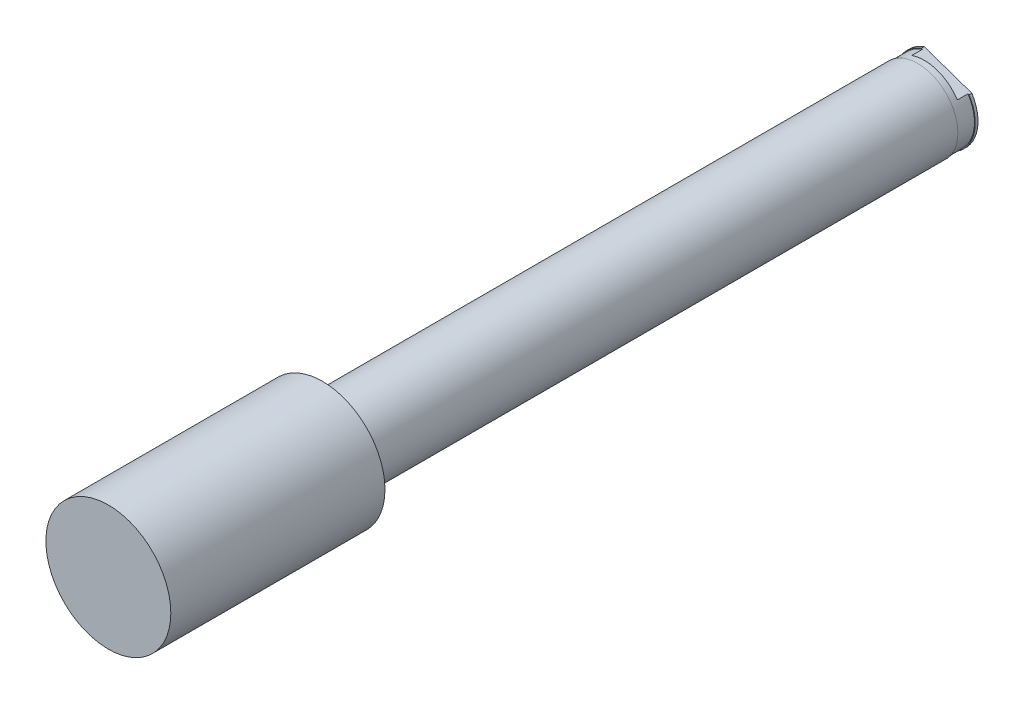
ISO-10303-21;
HEADER;
FILE_DESCRIPTION(('STEP AP214'),'2;1');
FILE_NAME('part.step','',(''),(''),'','','');
FILE_SCHEMA(('AUTOMOTIVE_DESIGN { 1 0 10303 214 1 1 1 1 }'));
ENDSEC;
DATA;
#1=APPLICATION_CONTEXT('core data for automotive mechanical design processes');
#2=APPLICATION_PROTOCOL_DEFINITION('international standard','automotive_design',2000,#1);
#3=PRODUCT_CONTEXT('',#1,'mechanical');
#4=PRODUCT('Part','Part','',(#3));
#5=PRODUCT_RELATED_PRODUCT_CATEGORY('part','',(#4));
#6=PRODUCT_DEFINITION_FORMATION('','',#4);
#7=PRODUCT_DEFINITION_CONTEXT('part definition',#1,'design');
#8=PRODUCT_DEFINITION('design','',#6,#7);
#9=PRODUCT_DEFINITION_SHAPE('','',#8);
#10=(LENGTH_UNIT() NAMED_UNIT(*) SI_UNIT(.MILLI.,.METRE.));
#11=(NAMED_UNIT(*) PLANE_ANGLE_UNIT() SI_UNIT($,.RADIAN.));
#12=(NAMED_UNIT(*) SI_UNIT($,.STERADIAN.) SOLID_ANGLE_UNIT());
#13=UNCERTAINTY_MEASURE_WITH_UNIT(LENGTH_MEASURE(1.E-05),#10,'distance_accuracy_value','');
#14=(GEOMETRIC_REPRESENTATION_CONTEXT(3) GLOBAL_UNCERTAINTY_ASSIGNED_CONTEXT((#13)) GLOBAL_UNIT_ASSIGNED_CONTEXT((#10,
#11,#12)) REPRESENTATION_CONTEXT('',''));
#15=CARTESIAN_POINT('',(0.,0.,0.));
#16=DIRECTION('',(0.,0.,1.));
#17=DIRECTION('',(1.,0.,0.));
#18=AXIS2_PLACEMENT_3D('',#15,#16,#17);
#19=CARTESIAN_POINT('',(0.,0.,38.1));
#20=DIRECTION('',(0.,0.,-1.));
#21=DIRECTION('',(-1.,0.,0.));
#22=AXIS2_PLACEMENT_3D('',#19,#20,#21);
#23=CYLINDRICAL_SURFACE('',#22,11.1125);
#24=CARTESIAN_POINT('',(0.,0.,38.1));
#25=DIRECTION('',(0.,0.,1.));
#26=DIRECTION('',(1.,0.,0.));
#27=AXIS2_PLACEMENT_3D('',#24,#25,#26);
#28=CIRCLE('',#27,11.1125);
#29=CARTESIAN_POINT('',(11.1125,0.,38.1));
#30=VERTEX_POINT('',#29);
#31=EDGE_CURVE('E167',#30,#30,#28,.T.);
#32=ORIENTED_EDGE('',*,*,#31,.F.);
#33=EDGE_LOOP('',(#32));
#34=FACE_BOUND('',#33,.T.);
#35=CARTESIAN_POINT('',(0.,0.,0.));
#36=DIRECTION('',(0.,0.,1.));
#37=DIRECTION('',(1.,0.,0.));
#38=AXIS2_PLACEMENT_3D('',#35,#36,#37);
#39=CIRCLE('',#38,11.1125);
#40=CARTESIAN_POINT('',(11.1125,0.,0.));
#41=VERTEX_POINT('',#40);
#42=EDGE_CURVE('E168',#41,#41,#39,.T.);
#43=ORIENTED_EDGE('',*,*,#42,.T.);
#44=EDGE_LOOP('',(#43));
#45=FACE_BOUND('',#44,.T.);
#46=ADVANCED_FACE('F16',(#34,#45),#23,.T.);
#47=CARTESIAN_POINT('',(0.,0.,38.1));
#48=DIRECTION('',(0.,0.,1.));
#49=DIRECTION('',(1.,0.,0.));
#50=AXIS2_PLACEMENT_3D('',#47,#48,#49);
#51=PLANE('',#50);
#52=ORIENTED_EDGE('',*,*,#31,.T.);
#53=EDGE_LOOP('',(#52));
#54=FACE_BOUND('',#53,.T.);
#55=ADVANCED_FACE('F359',(#54),#51,.T.);
#56=CARTESIAN_POINT('',(0.,0.,0.));
#57=DIRECTION('',(0.,0.,1.));
#58=DIRECTION('',(1.,0.,0.));
#59=AXIS2_PLACEMENT_3D('',#56,#57,#58);
#60=PLANE('',#59);
#61=CARTESIAN_POINT('',(0.,0.,0.));
#62=DIRECTION('',(0.,0.,1.));
#63=DIRECTION('',(1.,0.,0.));
#64=AXIS2_PLACEMENT_3D('',#61,#62,#63);
#65=CIRCLE('',#64,7.1501);
#66=CARTESIAN_POINT('',(7.1501,0.,0.));
#67=VERTEX_POINT('',#66);
#68=EDGE_CURVE('E161',#67,#67,#65,.T.);
#69=ORIENTED_EDGE('',*,*,#68,.T.);
#70=EDGE_LOOP('',(#69));
#71=FACE_BOUND('',#70,.T.);
#72=ORIENTED_EDGE('',*,*,#42,.F.);
#73=EDGE_LOOP('',(#72));
#74=FACE_BOUND('',#73,.T.);
#75=ADVANCED_FACE('F348',(#71,#74),#60,.F.);
#76=CARTESIAN_POINT('',(0.,7.1501,-105.88259999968));
#77=DIRECTION('',(0.,0.,-1.));
#78=DIRECTION('',(-1.,0.,0.));
#79=AXIS2_PLACEMENT_3D('',#76,#77,#78);
#80=PLANE('',#79);
#81=CARTESIAN_POINT('',(0.,0.,-105.88259999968));
#82=DIRECTION('',(0.,0.,-1.));
#83=DIRECTION('',(-1.,0.,0.));
#84=AXIS2_PLACEMENT_3D('',#81,#82,#83);
#85=CIRCLE('',#84,7.0231);
#86=CARTESIAN_POINT('',(-7.0231,0.,-105.88259999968));
#87=VERTEX_POINT('',#86);
#88=EDGE_CURVE('E10',#87,#87,#85,.T.);
#89=ORIENTED_EDGE('',*,*,#88,.F.);
#90=EDGE_LOOP('',(#89));
#91=FACE_BOUND('',#90,.T.);
#92=CARTESIAN_POINT('',(0.,0.,-105.88259999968));
#93=DIRECTION('',(0.,0.,1.));
#94=DIRECTION('',(1.,0.,0.));
#95=AXIS2_PLACEMENT_3D('',#92,#93,#94);
#96=CIRCLE('',#95,7.1501);
#97=CARTESIAN_POINT('',(7.1501,0.,-105.88259999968));
#98=VERTEX_POINT('',#97);
#99=EDGE_CURVE('E164',#98,#98,#96,.T.);
#100=ORIENTED_EDGE('',*,*,#99,.F.);
#101=EDGE_LOOP('',(#100));
#102=FACE_BOUND('',#101,.T.);
#103=ADVANCED_FACE('F337',(#91,#102),#80,.T.);
#104=CARTESIAN_POINT('',(0.,0.,-71.8992983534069));
#105=DIRECTION('',(0.,0.,1.));
#106=DIRECTION('',(1.,0.,0.));
#107=AXIS2_PLACEMENT_3D('',#104,#105,#106);
#108=CYLINDRICAL_SURFACE('',#107,7.1501);
#109=ORIENTED_EDGE('',*,*,#99,.T.);
#110=EDGE_LOOP('',(#109));
#111=FACE_BOUND('',#110,.T.);
#112=ORIENTED_EDGE('',*,*,#68,.F.);
#113=EDGE_LOOP('',(#112));
#114=FACE_BOUND('',#113,.T.);
#115=ADVANCED_FACE('F326',(#111,#114),#108,.T.);
#116=CARTESIAN_POINT('',(0.,0.,-90.41399999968));
#117=DIRECTION('',(0.,0.,-1.));
#118=DIRECTION('',(-1.,0.,0.));
#119=AXIS2_PLACEMENT_3D('',#116,#117,#118);
#120=PLANE('',#119);
#121=CARTESIAN_POINT('',(0.,0.,-90.41399999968));
#122=DIRECTION('',(0.,0.,-1.));
#123=DIRECTION('',(-1.,0.,0.));
#124=AXIS2_PLACEMENT_3D('',#121,#122,#123);
#125=CIRCLE('',#124,2.7051);
#126=CARTESIAN_POINT('',(-2.7051,0.,-90.41399999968));
#127=VERTEX_POINT('',#126);
#128=EDGE_CURVE('E155',#127,#127,#125,.T.);
#129=ORIENTED_EDGE('',*,*,#128,.T.);
#130=EDGE_LOOP('',(#129));
#131=FACE_BOUND('',#130,.T.);
#132=ADVANCED_FACE('F176',(#131),#120,.T.);
#133=CARTESIAN_POINT('',(0.,0.,-90.41399999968));
#134=DIRECTION('',(0.,0.,-1.));
#135=DIRECTION('',(-1.,0.,0.));
#136=AXIS2_PLACEMENT_3D('',#133,#134,#135);
#137=CYLINDRICAL_SURFACE('',#136,2.7051);
#138=ORIENTED_EDGE('',*,*,#128,.F.);
#139=EDGE_LOOP('',(#138));
#140=FACE_BOUND('',#139,.T.);
#141=CARTESIAN_POINT('',(0.,0.,-93.96399999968));
#142=DIRECTION('',(0.,0.,-1.));
#143=DIRECTION('',(-1.,0.,0.));
#144=AXIS2_PLACEMENT_3D('',#141,#142,#143);
#145=CIRCLE('',#144,2.7051);
#146=CARTESIAN_POINT('',(-2.7051,0.,-93.96399999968));
#147=VERTEX_POINT('',#146);
#148=EDGE_CURVE('E25',#147,#147,#145,.F.);
#149=ORIENTED_EDGE('',*,*,#148,.F.);
#150=EDGE_LOOP('',(#149));
#151=FACE_BOUND('',#150,.T.);
#152=ADVANCED_FACE('F178',(#140,#151),#137,.F.);
#153=CARTESIAN_POINT('',(0.,0.,-109.46399999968));
#154=DIRECTION('',(0.,0.,-1.));
#155=DIRECTION('',(-0.945518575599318,0.325568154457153,0.));
#156=AXIS2_PLACEMENT_3D('',#153,#154,#155);
#157=CYLINDRICAL_SURFACE('',#156,3.125);
#158=CARTESIAN_POINT('',(0.,0.,-108.96399999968));
#159=DIRECTION('',(0.,0.,-1.));
#160=DIRECTION('',(-1.,0.,0.));
#161=AXIS2_PLACEMENT_3D('',#158,#159,#160);
#162=CIRCLE('',#161,3.125);
#163=CARTESIAN_POINT('',(-3.125,0.,-108.96399999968));
#164=VERTEX_POINT('',#163);
#165=EDGE_CURVE('E153',#164,#164,#162,.T.);
#166=ORIENTED_EDGE('',*,*,#165,.F.);
#167=EDGE_LOOP('',(#166));
#168=FACE_BOUND('',#167,.T.);
#169=CARTESIAN_POINT('',(0.,0.,-109.46399999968));
#170=DIRECTION('',(0.,0.,-1.));
#171=DIRECTION('',(-0.945518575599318,0.325568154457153,0.));
#172=AXIS2_PLACEMENT_3D('',#169,#170,#171);
#173=CIRCLE('',#172,3.125);
#174=CARTESIAN_POINT('',(-2.95474554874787,1.0174004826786,-109.46399999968));
#175=VERTEX_POINT('',#174);
#176=EDGE_CURVE('E137',#175,#175,#173,.T.);
#177=ORIENTED_EDGE('',*,*,#176,.T.);
#178=EDGE_LOOP('',(#177));
#179=FACE_BOUND('',#178,.T.);
#180=ADVANCED_FACE('F181',(#168,#179),#157,.F.);
#181=CARTESIAN_POINT('',(0.,0.,-108.96399999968));
#182=DIRECTION('',(0.,0.,-1.));
#183=DIRECTION('',(-0.945518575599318,0.325568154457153,0.));
#184=AXIS2_PLACEMENT_3D('',#181,#182,#183);
#185=PLANE('',#184);
#186=CARTESIAN_POINT('',(0.,0.,-108.96399999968));
#187=DIRECTION('',(0.,0.,-1.));
#188=DIRECTION('',(-0.945518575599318,0.325568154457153,0.));
#189=AXIS2_PLACEMENT_3D('',#186,#187,#188);
#190=CIRCLE('',#189,2.50063);
#191=CARTESIAN_POINT('',(-2.36439211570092,0.81412549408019,-108.96399999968));
#192=VERTEX_POINT('',#191);
#193=EDGE_CURVE('E110',#192,#192,#190,.T.);
#194=ORIENTED_EDGE('',*,*,#193,.F.);
#195=EDGE_LOOP('',(#194));
#196=FACE_BOUND('',#195,.T.);
#197=ORIENTED_EDGE('',*,*,#165,.T.);
#198=EDGE_LOOP('',(#197));
#199=FACE_BOUND('',#198,.T.);
#200=ADVANCED_FACE('F198',(#196,#199),#185,.T.);
#201=CARTESIAN_POINT('',(0.,0.,-93.96399999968));
#202=DIRECTION('',(0.,0.,-1.));
#203=DIRECTION('',(-0.945518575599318,0.325568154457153,0.));
#204=AXIS2_PLACEMENT_3D('',#201,#202,#203);
#205=CYLINDRICAL_SURFACE('',#204,2.50063);
#206=CARTESIAN_POINT('',(0.,0.,-93.96399999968));
#207=DIRECTION('',(0.,0.,-1.));
#208=DIRECTION('',(-0.945518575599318,0.325568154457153,0.));
#209=AXIS2_PLACEMENT_3D('',#206,#207,#208);
#210=CIRCLE('',#209,2.50063);
#211=CARTESIAN_POINT('',(-2.36439211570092,0.81412549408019,-93.96399999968));
#212=VERTEX_POINT('',#211);
#213=EDGE_CURVE('E112',#212,#212,#210,.T.);
#214=ORIENTED_EDGE('',*,*,#213,.F.);
#215=EDGE_LOOP('',(#214));
#216=FACE_BOUND('',#215,.T.);
#217=ORIENTED_EDGE('',*,*,#193,.T.);
#218=EDGE_LOOP('',(#217));
#219=FACE_BOUND('',#218,.T.);
#220=ADVANCED_FACE('F187',(#216,#219),#205,.F.);
#221=CARTESIAN_POINT('',(0.,0.,-93.96399999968));
#222=DIRECTION('',(0.,0.,-1.));
#223=DIRECTION('',(-0.945518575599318,0.325568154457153,0.));
#224=AXIS2_PLACEMENT_3D('',#221,#222,#223);
#225=PLANE('',#224);
#226=ORIENTED_EDGE('',*,*,#213,.T.);
#227=EDGE_LOOP('',(#226));
#228=FACE_BOUND('',#227,.T.);
#229=ORIENTED_EDGE('',*,*,#148,.T.);
#230=EDGE_LOOP('',(#229));
#231=FACE_BOUND('',#230,.T.);
#232=ADVANCED_FACE('F185',(#228,#231),#225,.F.);
#233=CARTESIAN_POINT('',(0.,0.,-109.46399999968));
#234=DIRECTION('',(0.,0.,1.));
#235=DIRECTION('',(0.945518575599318,-0.325568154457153,0.));
#236=AXIS2_PLACEMENT_3D('',#233,#234,#235);
#237=PLANE('',#236);
#238=CARTESIAN_POINT('',(0.,0.,-109.46399999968));
#239=DIRECTION('',(0.,0.,-1.));
#240=DIRECTION('',(-0.945518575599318,0.325568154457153,0.));
#241=AXIS2_PLACEMENT_3D('',#238,#239,#240);
#242=CIRCLE('',#241,7.1501);
#243=CARTESIAN_POINT('',(-6.0586271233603,-3.79696818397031,-109.46399999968));
#244=VERTEX_POINT('',#243);
#245=CARTESIAN_POINT('',(-2.43661629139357,6.72211507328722,-109.46399999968));
#246=VERTEX_POINT('',#245);
#247=EDGE_CURVE('E116',#244,#246,#242,.T.);
#248=ORIENTED_EDGE('',*,*,#247,.T.);
#249=DIRECTION('',(-0.945518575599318,0.325568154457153,0.));
#250=VECTOR('',#249,1.);
#251=CARTESIAN_POINT('',(6.05862712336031,3.7969681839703,-109.46399999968));
#252=LINE('',#251,#250);
#253=CARTESIAN_POINT('',(6.05862712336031,3.7969681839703,-109.46399999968));
#254=VERTEX_POINT('',#253);
#255=EDGE_CURVE('E135',#254,#246,#252,.T.);
#256=ORIENTED_EDGE('',*,*,#255,.F.);
#257=CARTESIAN_POINT('',(2.43661629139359,-6.72211507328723,-109.46399999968));
#258=VERTEX_POINT('',#257);
#259=EDGE_CURVE('E119',#254,#258,#242,.T.);
#260=ORIENTED_EDGE('',*,*,#259,.T.);
#261=DIRECTION('',(0.945518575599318,-0.325568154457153,0.));
#262=VECTOR('',#261,1.);
#263=CARTESIAN_POINT('',(2.43661629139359,-6.72211507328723,-109.46399999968));
#264=LINE('',#263,#262);
#265=EDGE_CURVE('E126',#244,#258,#264,.T.);
#266=ORIENTED_EDGE('',*,*,#265,.F.);
#267=EDGE_LOOP('',(#248,#256,#260,#266));
#268=FACE_BOUND('',#267,.T.);
#269=ORIENTED_EDGE('',*,*,#176,.F.);
#270=EDGE_LOOP('',(#269));
#271=FACE_BOUND('',#270,.T.);
#272=ADVANCED_FACE('F18',(#268,#271),#237,.F.);
#273=CARTESIAN_POINT('',(0.,0.,-110.458542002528));
#274=DIRECTION('',(0.,0.,-1.));
#275=DIRECTION('',(-0.945518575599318,0.325568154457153,0.));
#276=AXIS2_PLACEMENT_3D('',#273,#274,#275);
#277=CYLINDRICAL_SURFACE('',#276,7.1501);
#278=DIRECTION('',(0.,0.,-1.));
#279=VECTOR('',#278,1.);
#280=CARTESIAN_POINT('',(-6.0586271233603,-3.79696818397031,-107.07639999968));
#281=LINE('',#280,#279);
#282=CARTESIAN_POINT('',(-6.0586271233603,-3.79696818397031,-108.96399999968));
#283=VERTEX_POINT('',#282);
#284=EDGE_CURVE('E122',#283,#244,#281,.T.);
#285=ORIENTED_EDGE('',*,*,#284,.F.);
#286=CARTESIAN_POINT('',(0.,0.,-108.96399999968));
#287=DIRECTION('',(0.,0.,-1.));
#288=DIRECTION('',(-0.945518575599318,0.325568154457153,0.));
#289=AXIS2_PLACEMENT_3D('',#286,#287,#288);
#290=CIRCLE('',#289,7.1501);
#291=CARTESIAN_POINT('',(-2.43661629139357,6.72211507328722,-108.96399999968));
#292=VERTEX_POINT('',#291);
#293=EDGE_CURVE('E151',#283,#292,#290,.T.);
#294=ORIENTED_EDGE('',*,*,#293,.T.);
#295=DIRECTION('',(0.,0.,-1.));
#296=VECTOR('',#295,1.);
#297=CARTESIAN_POINT('',(-2.43661629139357,6.72211507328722,-107.07639999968));
#298=LINE('',#297,#296);
#299=EDGE_CURVE('E109',#292,#246,#298,.T.);
#300=ORIENTED_EDGE('',*,*,#299,.T.);
#301=ORIENTED_EDGE('',*,*,#247,.F.);
#302=EDGE_LOOP('',(#285,#294,#300,#301));
#303=FACE_BOUND('',#302,.T.);
#304=ADVANCED_FACE('F196',(#303),#277,.T.);
#305=DIRECTION('',(0.,0.,-1.));
#306=VECTOR('',#305,1.);
#307=CARTESIAN_POINT('',(6.05862712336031,3.7969681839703,-107.07639999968));
#308=LINE('',#307,#306);
#309=CARTESIAN_POINT('',(6.05862712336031,3.7969681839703,-108.96399999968));
#310=VERTEX_POINT('',#309);
#311=EDGE_CURVE('E131',#310,#254,#308,.T.);
#312=ORIENTED_EDGE('',*,*,#311,.F.);
#313=CARTESIAN_POINT('',(2.43661629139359,-6.72211507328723,-108.96399999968));
#314=VERTEX_POINT('',#313);
#315=EDGE_CURVE('E150',#310,#314,#290,.T.);
#316=ORIENTED_EDGE('',*,*,#315,.T.);
#317=DIRECTION('',(0.,0.,-1.));
#318=VECTOR('',#317,1.);
#319=CARTESIAN_POINT('',(2.43661629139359,-6.72211507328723,-107.07639999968));
#320=LINE('',#319,#318);
#321=EDGE_CURVE('E41',#314,#258,#320,.T.);
#322=ORIENTED_EDGE('',*,*,#321,.T.);
#323=ORIENTED_EDGE('',*,*,#259,.F.);
#324=EDGE_LOOP('',(#312,#316,#322,#323));
#325=FACE_BOUND('',#324,.T.);
#326=ADVANCED_FACE('F224',(#325),#277,.T.);
#327=CARTESIAN_POINT('',(0.,0.,-107.07639999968));
#328=DIRECTION('',(0.,0.,-1.));
#329=DIRECTION('',(-0.945518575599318,0.325568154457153,0.));
#330=AXIS2_PLACEMENT_3D('',#327,#328,#329);
#331=PLANE('',#330);
#332=DIRECTION('',(0.945518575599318,-0.325568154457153,0.));
#333=VECTOR('',#332,1.);
#334=CARTESIAN_POINT('',(2.43661629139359,-6.72211507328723,-107.07639999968));
#335=LINE('',#334,#333);
#336=CARTESIAN_POINT('',(-5.86477942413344,-3.86371529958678,-107.07639999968));
#337=VERTEX_POINT('',#336);
#338=CARTESIAN_POINT('',(2.24276859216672,-6.65536795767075,-107.07639999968));
#339=VERTEX_POINT('',#338);
#340=EDGE_CURVE('E124',#337,#339,#335,.T.);
#341=ORIENTED_EDGE('',*,*,#340,.T.);
#342=CARTESIAN_POINT('',(0.,0.,-107.07639999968));
#343=DIRECTION('',(0.,0.,-1.));
#344=DIRECTION('',(-0.945518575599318,0.325568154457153,0.));
#345=AXIS2_PLACEMENT_3D('',#342,#343,#344);
#346=CIRCLE('',#345,7.0231);
#347=EDGE_CURVE('E96',#339,#337,#346,.T.);
#348=ORIENTED_EDGE('',*,*,#347,.T.);
#349=EDGE_LOOP('',(#341,#348));
#350=FACE_BOUND('',#349,.T.);
#351=ADVANCED_FACE('F221',(#350),#331,.T.);
#352=CARTESIAN_POINT('',(0.,0.,-108.96399999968));
#353=DIRECTION('',(0.,0.,-1.));
#354=DIRECTION('',(-0.945518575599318,0.325568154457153,0.));
#355=AXIS2_PLACEMENT_3D('',#352,#353,#354);
#356=PLANE('',#355);
#357=CARTESIAN_POINT('',(0.,0.,-108.96399999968));
#358=DIRECTION('',(0.,0.,-1.));
#359=DIRECTION('',(-0.945518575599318,0.325568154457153,0.));
#360=AXIS2_PLACEMENT_3D('',#357,#358,#359);
#361=CIRCLE('',#360,7.0231);
#362=CARTESIAN_POINT('',(-5.86477942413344,-3.86371529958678,-108.96399999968));
#363=VERTEX_POINT('',#362);
#364=CARTESIAN_POINT('',(-2.24276859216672,6.65536795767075,-108.96399999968));
#365=VERTEX_POINT('',#364);
#366=EDGE_CURVE('E89',#363,#365,#361,.T.);
#367=ORIENTED_EDGE('',*,*,#366,.T.);
#368=DIRECTION('',(0.945518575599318,-0.325568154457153,0.));
#369=VECTOR('',#368,1.);
#370=CARTESIAN_POINT('',(6.05862712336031,3.7969681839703,-108.96399999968));
#371=LINE('',#370,#369);
#372=EDGE_CURVE('E100',#292,#365,#371,.T.);
#373=ORIENTED_EDGE('',*,*,#372,.F.);
#374=ORIENTED_EDGE('',*,*,#293,.F.);
#375=DIRECTION('',(-0.945518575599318,0.325568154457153,0.));
#376=VECTOR('',#375,1.);
#377=CARTESIAN_POINT('',(2.43661629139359,-6.72211507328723,-108.96399999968));
#378=LINE('',#377,#376);
#379=EDGE_CURVE('E103',#363,#283,#378,.T.);
#380=ORIENTED_EDGE('',*,*,#379,.F.);
#381=EDGE_LOOP('',(#367,#373,#374,#380));
#382=FACE_BOUND('',#381,.T.);
#383=ADVANCED_FACE('F99',(#382),#356,.F.);
#384=CARTESIAN_POINT('',(0.,0.,-107.07639999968));
#385=DIRECTION('',(0.,0.,-1.));
#386=DIRECTION('',(-0.945518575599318,0.325568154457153,0.));
#387=AXIS2_PLACEMENT_3D('',#384,#385,#386);
#388=PLANE('',#387);
#389=DIRECTION('',(-0.945518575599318,0.325568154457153,0.));
#390=VECTOR('',#389,1.);
#391=CARTESIAN_POINT('',(6.05862712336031,3.7969681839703,-107.07639999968));
#392=LINE('',#391,#390);
#393=CARTESIAN_POINT('',(5.86477942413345,3.86371529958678,-107.07639999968));
#394=VERTEX_POINT('',#393);
#395=CARTESIAN_POINT('',(-2.24276859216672,6.65536795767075,-107.07639999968));
#396=VERTEX_POINT('',#395);
#397=EDGE_CURVE('E133',#394,#396,#392,.T.);
#398=ORIENTED_EDGE('',*,*,#397,.T.);
#399=CARTESIAN_POINT('',(0.,0.,-107.07639999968));
#400=DIRECTION('',(0.,0.,-1.));
#401=DIRECTION('',(-0.945518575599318,0.325568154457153,0.));
#402=AXIS2_PLACEMENT_3D('',#399,#400,#401);
#403=CIRCLE('',#402,7.0231);
#404=EDGE_CURVE('E91',#396,#394,#403,.T.);
#405=ORIENTED_EDGE('',*,*,#404,.T.);
#406=EDGE_LOOP('',(#398,#405));
#407=FACE_BOUND('',#406,.T.);
#408=ADVANCED_FACE('F216',(#407),#388,.T.);
#409=CARTESIAN_POINT('',(6.05862712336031,3.7969681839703,-107.07639999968));
#410=DIRECTION('',(-0.325568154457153,-0.945518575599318,0.));
#411=DIRECTION('',(0.,0.,1.));
#412=AXIS2_PLACEMENT_3D('',#409,#410,#411);
#413=PLANE('',#412);
#414=ORIENTED_EDGE('',*,*,#299,.F.);
#415=ORIENTED_EDGE('',*,*,#372,.T.);
#416=DIRECTION('',(0.,0.,-1.));
#417=VECTOR('',#416,1.);
#418=CARTESIAN_POINT('',(-2.24276859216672,6.65536795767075,-105.15399999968));
#419=LINE('',#418,#417);
#420=EDGE_CURVE('E85',#396,#365,#419,.T.);
#421=ORIENTED_EDGE('',*,*,#420,.F.);
#422=ORIENTED_EDGE('',*,*,#397,.F.);
#423=DIRECTION('',(0.,0.,-1.));
#424=VECTOR('',#423,1.);
#425=CARTESIAN_POINT('',(5.86477942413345,3.86371529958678,-105.15399999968));
#426=LINE('',#425,#424);
#427=CARTESIAN_POINT('',(5.86477942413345,3.86371529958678,-108.96399999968));
#428=VERTEX_POINT('',#427);
#429=EDGE_CURVE('E33',#428,#394,#426,.F.);
#430=ORIENTED_EDGE('',*,*,#429,.F.);
#431=EDGE_CURVE('E20',#428,#310,#371,.T.);
#432=ORIENTED_EDGE('',*,*,#431,.T.);
#433=ORIENTED_EDGE('',*,*,#311,.T.);
#434=ORIENTED_EDGE('',*,*,#255,.T.);
#435=EDGE_LOOP('',(#414,#415,#421,#422,#430,#432,#433,#434));
#436=FACE_BOUND('',#435,.T.);
#437=ADVANCED_FACE('F107',(#436),#413,.F.);
#438=ORIENTED_EDGE('',*,*,#315,.F.);
#439=ORIENTED_EDGE('',*,*,#431,.F.);
#440=CARTESIAN_POINT('',(2.24276859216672,-6.65536795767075,-108.96399999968));
#441=VERTEX_POINT('',#440);
#442=EDGE_CURVE('E104',#428,#441,#361,.T.);
#443=ORIENTED_EDGE('',*,*,#442,.T.);
#444=EDGE_CURVE('E141',#314,#441,#378,.T.);
#445=ORIENTED_EDGE('',*,*,#444,.F.);
#446=EDGE_LOOP('',(#438,#439,#443,#445));
#447=FACE_BOUND('',#446,.T.);
#448=ADVANCED_FACE('F214',(#447),#356,.F.);
#449=CARTESIAN_POINT('',(2.43661629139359,-6.72211507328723,-107.07639999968));
#450=DIRECTION('',(0.325568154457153,0.945518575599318,0.));
#451=DIRECTION('',(0.,0.,-1.));
#452=AXIS2_PLACEMENT_3D('',#449,#450,#451);
#453=PLANE('',#452);
#454=ORIENTED_EDGE('',*,*,#321,.F.);
#455=ORIENTED_EDGE('',*,*,#444,.T.);
#456=DIRECTION('',(0.,0.,-1.));
#457=VECTOR('',#456,1.);
#458=CARTESIAN_POINT('',(2.24276859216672,-6.65536795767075,-105.15399999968));
#459=LINE('',#458,#457);
#460=EDGE_CURVE('E143',#339,#441,#459,.T.);
#461=ORIENTED_EDGE('',*,*,#460,.F.);
#462=ORIENTED_EDGE('',*,*,#340,.F.);
#463=DIRECTION('',(0.,0.,-1.));
#464=VECTOR('',#463,1.);
#465=CARTESIAN_POINT('',(-5.86477942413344,-3.86371529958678,-105.15399999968));
#466=LINE('',#465,#464);
#467=EDGE_CURVE('E145',#363,#337,#466,.F.);
#468=ORIENTED_EDGE('',*,*,#467,.F.);
#469=ORIENTED_EDGE('',*,*,#379,.T.);
#470=ORIENTED_EDGE('',*,*,#284,.T.);
#471=ORIENTED_EDGE('',*,*,#265,.T.);
#472=EDGE_LOOP('',(#454,#455,#461,#462,#468,#469,#470,#471));
#473=FACE_BOUND('',#472,.T.);
#474=ADVANCED_FACE('F226',(#473),#453,.F.);
#475=CARTESIAN_POINT('',(0.,0.,-105.15399999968));
#476=DIRECTION('',(0.,0.,-1.));
#477=DIRECTION('',(-0.945518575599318,0.325568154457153,0.));
#478=AXIS2_PLACEMENT_3D('',#475,#476,#477);
#479=CYLINDRICAL_SURFACE('',#478,7.0231);
#480=ORIENTED_EDGE('',*,*,#460,.T.);
#481=ORIENTED_EDGE('',*,*,#442,.F.);
#482=ORIENTED_EDGE('',*,*,#429,.T.);
#483=ORIENTED_EDGE('',*,*,#404,.F.);
#484=ORIENTED_EDGE('',*,*,#420,.T.);
#485=ORIENTED_EDGE('',*,*,#366,.F.);
#486=ORIENTED_EDGE('',*,*,#467,.T.);
#487=ORIENTED_EDGE('',*,*,#347,.F.);
#488=EDGE_LOOP('',(#480,#481,#482,#483,#484,#485,#486,#487));
#489=FACE_BOUND('',#488,.T.);
#490=ORIENTED_EDGE('',*,*,#88,.T.);
#491=EDGE_LOOP('',(#490));
#492=FACE_BOUND('',#491,.T.);
#493=ADVANCED_FACE('F87',(#489,#492),#479,.T.);
#494=CLOSED_SHELL('',(#46,#55,#75,#103,#115,#132,#152,#180,#200,#220,#232,#272,#304,#326,#351,
#383,#408,#437,#448,#474,#493));
#495=MANIFOLD_SOLID_BREP('B1',#494);
#496=ADVANCED_BREP_SHAPE_REPRESENTATION('',(#18,#495),#14);
#497=SHAPE_DEFINITION_REPRESENTATION(#9,#496);
ENDSEC;
END-ISO-10303-21;
